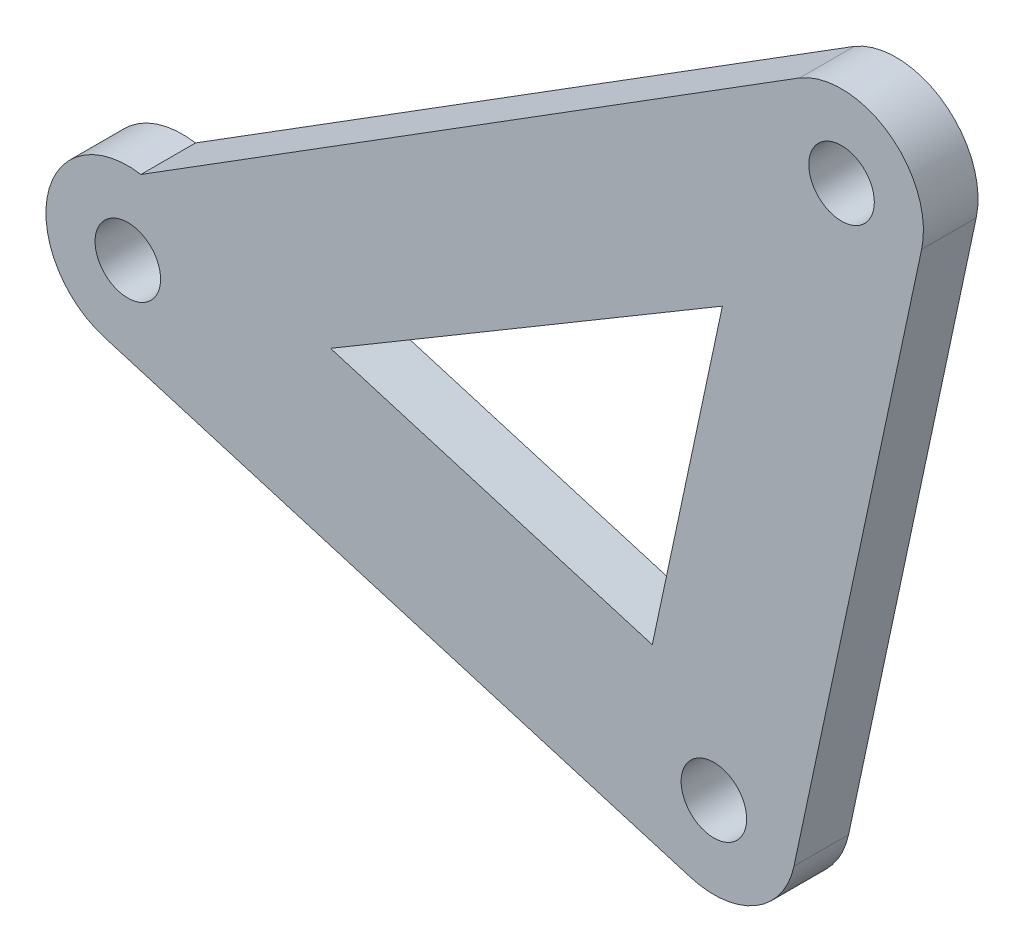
ISO-10303-21;
HEADER;
FILE_DESCRIPTION(('STEP AP214'),'2;1');
FILE_NAME('part.step','',(''),(''),'','','');
FILE_SCHEMA(('AUTOMOTIVE_DESIGN { 1 0 10303 214 1 1 1 1 }'));
ENDSEC;
DATA;
#1=APPLICATION_CONTEXT('core data for automotive mechanical design processes');
#2=APPLICATION_PROTOCOL_DEFINITION('international standard','automotive_design',2000,#1);
#3=PRODUCT_CONTEXT('',#1,'mechanical');
#4=PRODUCT('Part','Part','',(#3));
#5=PRODUCT_RELATED_PRODUCT_CATEGORY('part','',(#4));
#6=PRODUCT_DEFINITION_FORMATION('','',#4);
#7=PRODUCT_DEFINITION_CONTEXT('part definition',#1,'design');
#8=PRODUCT_DEFINITION('design','',#6,#7);
#9=PRODUCT_DEFINITION_SHAPE('','',#8);
#10=(LENGTH_UNIT() NAMED_UNIT(*) SI_UNIT(.MILLI.,.METRE.));
#11=(NAMED_UNIT(*) PLANE_ANGLE_UNIT() SI_UNIT($,.RADIAN.));
#12=(NAMED_UNIT(*) SI_UNIT($,.STERADIAN.) SOLID_ANGLE_UNIT());
#13=UNCERTAINTY_MEASURE_WITH_UNIT(LENGTH_MEASURE(1.E-05),#10,'distance_accuracy_value','');
#14=(GEOMETRIC_REPRESENTATION_CONTEXT(3) GLOBAL_UNCERTAINTY_ASSIGNED_CONTEXT((#13)) GLOBAL_UNIT_ASSIGNED_CONTEXT((#10,
#11,#12)) REPRESENTATION_CONTEXT('',''));
#15=CARTESIAN_POINT('',(0.,0.,0.));
#16=DIRECTION('',(0.,0.,1.));
#17=DIRECTION('',(1.,0.,0.));
#18=AXIS2_PLACEMENT_3D('',#15,#16,#17);
#19=CARTESIAN_POINT('',(-67.7284123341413,14.4587263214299,-5.));
#20=DIRECTION('',(0.977963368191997,-0.208776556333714,0.));
#21=DIRECTION('',(0.208776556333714,0.977963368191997,0.));
#22=AXIS2_PLACEMENT_3D('',#19,#20,#21);
#23=PLANE('',#22);
#24=DIRECTION('',(0.208776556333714,0.977963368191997,0.));
#25=VECTOR('',#24,1.);
#26=CARTESIAN_POINT('',(-67.7284123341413,14.4587263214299,0.));
#27=LINE('',#26,#25);
#28=CARTESIAN_POINT('',(-69.6397647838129,5.50545727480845,0.));
#29=VERTEX_POINT('',#28);
#30=CARTESIAN_POINT('',(-63.2214880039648,35.5703251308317,0.));
#31=VERTEX_POINT('',#30);
#32=EDGE_CURVE('E159',#29,#31,#27,.T.);
#33=ORIENTED_EDGE('',*,*,#32,.T.);
#34=DIRECTION('',(0.,0.,1.));
#35=VECTOR('',#34,1.);
#36=CARTESIAN_POINT('',(-63.2214880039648,35.5703251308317,-5.));
#37=LINE('',#36,#35);
#38=CARTESIAN_POINT('',(-63.2214880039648,35.5703251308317,-5.));
#39=VERTEX_POINT('',#38);
#40=EDGE_CURVE('E11',#39,#31,#37,.T.);
#41=ORIENTED_EDGE('',*,*,#40,.F.);
#42=DIRECTION('',(0.208776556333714,0.977963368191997,0.));
#43=VECTOR('',#42,1.);
#44=CARTESIAN_POINT('',(-67.7284123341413,14.4587263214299,-5.));
#45=LINE('',#44,#43);
#46=CARTESIAN_POINT('',(-69.6397647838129,5.50545727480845,-5.));
#47=VERTEX_POINT('',#46);
#48=EDGE_CURVE('E120',#47,#39,#45,.T.);
#49=ORIENTED_EDGE('',*,*,#48,.F.);
#50=DIRECTION('',(0.,0.,1.));
#51=VECTOR('',#50,1.);
#52=CARTESIAN_POINT('',(-69.6397647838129,5.50545727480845,-5.));
#53=LINE('',#52,#51);
#54=EDGE_CURVE('E125',#47,#29,#53,.T.);
#55=ORIENTED_EDGE('',*,*,#54,.T.);
#56=EDGE_LOOP('',(#33,#41,#49,#55));
#57=FACE_BOUND('',#56,.T.);
#58=ADVANCED_FACE('F39',(#57),#23,.F.);
#59=CARTESIAN_POINT('',(-32.0705181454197,54.0527755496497,-5.));
#60=DIRECTION('',(-0.510264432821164,0.860017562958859,0.));
#61=DIRECTION('',(-0.860017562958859,-0.510264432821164,0.));
#62=AXIS2_PLACEMENT_3D('',#59,#60,#61);
#63=PLANE('',#62);
#64=DIRECTION('',(-0.860017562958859,-0.510264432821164,0.));
#65=VECTOR('',#64,1.);
#66=CARTESIAN_POINT('',(-32.0705181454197,54.0527755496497,0.));
#67=LINE('',#66,#65);
#68=CARTESIAN_POINT('',(-99.1029059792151,14.2812117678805,0.));
#69=VERTEX_POINT('',#68);
#70=EDGE_CURVE('E86',#31,#69,#67,.T.);
#71=ORIENTED_EDGE('',*,*,#70,.T.);
#72=DIRECTION('',(0.,0.,1.));
#73=VECTOR('',#72,1.);
#74=CARTESIAN_POINT('',(-99.1029059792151,14.2812117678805,-5.));
#75=LINE('',#74,#73);
#76=CARTESIAN_POINT('',(-99.1029059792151,14.2812117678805,-5.));
#77=VERTEX_POINT('',#76);
#78=EDGE_CURVE('E49',#77,#69,#75,.T.);
#79=ORIENTED_EDGE('',*,*,#78,.F.);
#80=DIRECTION('',(-0.860017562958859,-0.510264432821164,0.));
#81=VECTOR('',#80,1.);
#82=CARTESIAN_POINT('',(-32.0705181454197,54.0527755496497,-5.));
#83=LINE('',#82,#81);
#84=EDGE_CURVE('E57',#39,#77,#83,.T.);
#85=ORIENTED_EDGE('',*,*,#84,.F.);
#86=ORIENTED_EDGE('',*,*,#40,.T.);
#87=EDGE_LOOP('',(#71,#79,#85,#86));
#88=FACE_BOUND('',#87,.T.);
#89=ADVANCED_FACE('F217',(#88),#63,.F.);
#90=CARTESIAN_POINT('',(-8.45055094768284,-28.3713241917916,-5.));
#91=DIRECTION('',(-0.285461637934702,-0.958390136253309,0.));
#92=DIRECTION('',(0.958390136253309,-0.285461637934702,0.));
#93=AXIS2_PLACEMENT_3D('',#90,#91,#92);
#94=PLANE('',#93);
#95=DIRECTION('',(0.958390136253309,-0.285461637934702,0.));
#96=VECTOR('',#95,1.);
#97=CARTESIAN_POINT('',(-8.45055094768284,-28.3713241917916,0.));
#98=LINE('',#97,#96);
#99=CARTESIAN_POINT('',(-119.810809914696,4.79792570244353,0.));
#100=VERTEX_POINT('',#99);
#101=CARTESIAN_POINT('',(-66.1409622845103,-11.1879260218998,0.));
#102=VERTEX_POINT('',#101);
#103=EDGE_CURVE('E140',#100,#102,#98,.T.);
#104=ORIENTED_EDGE('',*,*,#103,.F.);
#105=DIRECTION('',(0.,0.,1.));
#106=VECTOR('',#105,1.);
#107=CARTESIAN_POINT('',(-119.810809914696,4.79792570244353,-5.));
#108=LINE('',#107,#106);
#109=CARTESIAN_POINT('',(-119.810809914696,4.79792570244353,-5.));
#110=VERTEX_POINT('',#109);
#111=EDGE_CURVE('E130',#110,#100,#108,.T.);
#112=ORIENTED_EDGE('',*,*,#111,.F.);
#113=DIRECTION('',(0.958390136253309,-0.285461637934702,0.));
#114=VECTOR('',#113,1.);
#115=CARTESIAN_POINT('',(-8.45055094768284,-28.3713241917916,-5.));
#116=LINE('',#115,#114);
#117=CARTESIAN_POINT('',(-66.1409622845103,-11.1879260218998,-5.));
#118=VERTEX_POINT('',#117);
#119=EDGE_CURVE('E162',#110,#118,#116,.T.);
#120=ORIENTED_EDGE('',*,*,#119,.T.);
#121=DIRECTION('',(0.,0.,1.));
#122=VECTOR('',#121,1.);
#123=CARTESIAN_POINT('',(-66.1409622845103,-11.1879260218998,-5.));
#124=LINE('',#123,#122);
#125=EDGE_CURVE('E43',#118,#102,#124,.T.);
#126=ORIENTED_EDGE('',*,*,#125,.T.);
#127=EDGE_LOOP('',(#104,#112,#120,#126));
#128=FACE_BOUND('',#127,.T.);
#129=ADVANCED_FACE('F41',(#128),#94,.T.);
#130=CARTESIAN_POINT('',(-117.669847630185,11.9858517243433,-5.));
#131=DIRECTION('',(0.,0.,1.));
#132=DIRECTION('',(1.,0.,0.));
#133=AXIS2_PLACEMENT_3D('',#130,#131,#132);
#134=CYLINDRICAL_SURFACE('',#133,7.50000000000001);
#135=CARTESIAN_POINT('',(-117.669847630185,11.9858517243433,0.));
#136=DIRECTION('',(0.,0.,1.));
#137=DIRECTION('',(1.,0.,0.));
#138=AXIS2_PLACEMENT_3D('',#135,#136,#137);
#139=CIRCLE('',#138,7.50000000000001);
#140=CARTESIAN_POINT('',(-116.469329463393,19.389145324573,0.));
#141=VERTEX_POINT('',#140);
#142=EDGE_CURVE('E156',#141,#100,#139,.T.);
#143=ORIENTED_EDGE('',*,*,#142,.F.);
#144=DIRECTION('',(0.,0.,1.));
#145=VECTOR('',#144,1.);
#146=CARTESIAN_POINT('',(-116.469329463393,19.389145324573,-5.));
#147=LINE('',#146,#145);
#148=CARTESIAN_POINT('',(-116.469329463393,19.389145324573,-5.));
#149=VERTEX_POINT('',#148);
#150=EDGE_CURVE('E166',#149,#141,#147,.T.);
#151=ORIENTED_EDGE('',*,*,#150,.F.);
#152=CARTESIAN_POINT('',(-117.669847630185,11.9858517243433,-5.));
#153=DIRECTION('',(0.,0.,1.));
#154=DIRECTION('',(1.,0.,0.));
#155=AXIS2_PLACEMENT_3D('',#152,#153,#154);
#156=CIRCLE('',#155,7.50000000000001);
#157=EDGE_CURVE('E132',#149,#110,#156,.T.);
#158=ORIENTED_EDGE('',*,*,#157,.T.);
#159=ORIENTED_EDGE('',*,*,#111,.T.);
#160=EDGE_LOOP('',(#143,#151,#158,#159));
#161=FACE_BOUND('',#160,.T.);
#162=ADVANCED_FACE('F183',(#161),#134,.T.);
#163=CARTESIAN_POINT('',(-41.5898306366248,66.3356391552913,-5.));
#164=DIRECTION('',(-0.531192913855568,0.847250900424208,0.));
#165=DIRECTION('',(-0.847250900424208,-0.531192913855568,0.));
#166=AXIS2_PLACEMENT_3D('',#163,#164,#165);
#167=PLANE('',#166);
#168=DIRECTION('',(-0.847250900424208,-0.531192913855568,0.));
#169=VECTOR('',#168,1.);
#170=CARTESIAN_POINT('',(-41.5898306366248,66.3356391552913,0.));
#171=LINE('',#170,#169);
#172=CARTESIAN_POINT('',(-56.1354960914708,57.2160803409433,0.));
#173=VERTEX_POINT('',#172);
#174=EDGE_CURVE('E153',#173,#141,#171,.T.);
#175=ORIENTED_EDGE('',*,*,#174,.F.);
#176=DIRECTION('',(0.,0.,1.));
#177=VECTOR('',#176,1.);
#178=CARTESIAN_POINT('',(-56.1354960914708,57.2160803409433,-5.));
#179=LINE('',#178,#177);
#180=CARTESIAN_POINT('',(-56.1354960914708,57.2160803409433,-5.));
#181=VERTEX_POINT('',#180);
#182=EDGE_CURVE('E168',#181,#173,#179,.T.);
#183=ORIENTED_EDGE('',*,*,#182,.F.);
#184=DIRECTION('',(-0.847250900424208,-0.531192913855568,0.));
#185=VECTOR('',#184,1.);
#186=CARTESIAN_POINT('',(-41.5898306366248,66.3356391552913,-5.));
#187=LINE('',#186,#185);
#188=EDGE_CURVE('E135',#181,#149,#187,.T.);
#189=ORIENTED_EDGE('',*,*,#188,.T.);
#190=ORIENTED_EDGE('',*,*,#150,.T.);
#191=EDGE_LOOP('',(#175,#183,#189,#190));
#192=FACE_BOUND('',#191,.T.);
#193=ADVANCED_FACE('F202',(#192),#167,.T.);
#194=CARTESIAN_POINT('',(-52.308512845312,50.7659486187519,-5.));
#195=DIRECTION('',(0.,0.,1.));
#196=DIRECTION('',(1.,0.,0.));
#197=AXIS2_PLACEMENT_3D('',#194,#195,#196);
#198=CYLINDRICAL_SURFACE('',#197,7.50000000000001);
#199=CARTESIAN_POINT('',(-52.308512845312,50.7659486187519,0.));
#200=DIRECTION('',(0.,0.,1.));
#201=DIRECTION('',(1.,0.,0.));
#202=AXIS2_PLACEMENT_3D('',#199,#200,#201);
#203=CIRCLE('',#202,7.50000000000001);
#204=CARTESIAN_POINT('',(-44.9737875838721,49.200124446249,0.));
#205=VERTEX_POINT('',#204);
#206=EDGE_CURVE('E150',#205,#173,#203,.T.);
#207=ORIENTED_EDGE('',*,*,#206,.F.);
#208=DIRECTION('',(0.,0.,1.));
#209=VECTOR('',#208,1.);
#210=CARTESIAN_POINT('',(-44.9737875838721,49.200124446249,-5.));
#211=LINE('',#210,#209);
#212=CARTESIAN_POINT('',(-44.9737875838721,49.200124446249,-5.));
#213=VERTEX_POINT('',#212);
#214=EDGE_CURVE('E170',#213,#205,#211,.T.);
#215=ORIENTED_EDGE('',*,*,#214,.F.);
#216=CARTESIAN_POINT('',(-52.308512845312,50.7659486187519,-5.));
#217=DIRECTION('',(0.,0.,1.));
#218=DIRECTION('',(1.,0.,0.));
#219=AXIS2_PLACEMENT_3D('',#216,#217,#218);
#220=CIRCLE('',#219,7.50000000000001);
#221=EDGE_CURVE('E199',#213,#181,#220,.T.);
#222=ORIENTED_EDGE('',*,*,#221,.T.);
#223=ORIENTED_EDGE('',*,*,#182,.T.);
#224=EDGE_LOOP('',(#207,#215,#222,#223));
#225=FACE_BOUND('',#224,.T.);
#226=ADVANCED_FACE('F206',(#225),#198,.T.);
#227=CARTESIAN_POINT('',(-53.0589618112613,11.3270779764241,-5.));
#228=DIRECTION('',(0.977963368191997,-0.208776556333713,0.));
#229=DIRECTION('',(0.208776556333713,0.977963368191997,0.));
#230=AXIS2_PLACEMENT_3D('',#227,#228,#229);
#231=PLANE('',#230);
#232=DIRECTION('',(0.208776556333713,0.977963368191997,0.));
#233=VECTOR('',#232,1.);
#234=CARTESIAN_POINT('',(-53.0589618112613,11.3270779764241,0.));
#235=LINE('',#234,#233);
#236=CARTESIAN_POINT('',(-56.66527473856,-5.56582417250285,0.));
#237=VERTEX_POINT('',#236);
#238=EDGE_CURVE('E147',#237,#205,#235,.T.);
#239=ORIENTED_EDGE('',*,*,#238,.F.);
#240=DIRECTION('',(0.,0.,1.));
#241=VECTOR('',#240,1.);
#242=CARTESIAN_POINT('',(-56.66527473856,-5.56582417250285,-5.));
#243=LINE('',#242,#241);
#244=CARTESIAN_POINT('',(-56.66527473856,-5.56582417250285,-5.));
#245=VERTEX_POINT('',#244);
#246=EDGE_CURVE('E171',#245,#237,#243,.T.);
#247=ORIENTED_EDGE('',*,*,#246,.F.);
#248=DIRECTION('',(0.208776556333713,0.977963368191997,0.));
#249=VECTOR('',#248,1.);
#250=CARTESIAN_POINT('',(-53.0589618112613,11.3270779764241,-5.));
#251=LINE('',#250,#249);
#252=EDGE_CURVE('E191',#245,#213,#251,.T.);
#253=ORIENTED_EDGE('',*,*,#252,.T.);
#254=ORIENTED_EDGE('',*,*,#214,.T.);
#255=EDGE_LOOP('',(#239,#247,#253,#254));
#256=FACE_BOUND('',#255,.T.);
#257=ADVANCED_FACE('F208',(#256),#231,.T.);
#258=CARTESIAN_POINT('',(-64.,-4.00000000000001,-5.));
#259=DIRECTION('',(0.,0.,1.));
#260=DIRECTION('',(1.,0.,0.));
#261=AXIS2_PLACEMENT_3D('',#258,#259,#260);
#262=CYLINDRICAL_SURFACE('',#261,7.5);
#263=CARTESIAN_POINT('',(-64.,-4.00000000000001,0.));
#264=DIRECTION('',(0.,0.,1.));
#265=DIRECTION('',(1.,0.,0.));
#266=AXIS2_PLACEMENT_3D('',#263,#264,#265);
#267=CIRCLE('',#266,7.5);
#268=EDGE_CURVE('E143',#102,#237,#267,.T.);
#269=ORIENTED_EDGE('',*,*,#268,.F.);
#270=ORIENTED_EDGE('',*,*,#125,.F.);
#271=CARTESIAN_POINT('',(-64.,-4.00000000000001,-5.));
#272=DIRECTION('',(0.,0.,1.));
#273=DIRECTION('',(1.,0.,0.));
#274=AXIS2_PLACEMENT_3D('',#271,#272,#273);
#275=CIRCLE('',#274,7.5);
#276=EDGE_CURVE('E189',#118,#245,#275,.T.);
#277=ORIENTED_EDGE('',*,*,#276,.T.);
#278=ORIENTED_EDGE('',*,*,#246,.T.);
#279=EDGE_LOOP('',(#269,#270,#277,#278));
#280=FACE_BOUND('',#279,.T.);
#281=ADVANCED_FACE('F177',(#280),#262,.T.);
#282=CARTESIAN_POINT('',(-4.16862637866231,-13.995472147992,-5.));
#283=DIRECTION('',(-0.285461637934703,-0.958390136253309,0.));
#284=DIRECTION('',(0.958390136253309,-0.285461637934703,0.));
#285=AXIS2_PLACEMENT_3D('',#282,#283,#284);
#286=PLANE('',#285);
#287=DIRECTION('',(0.958390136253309,-0.285461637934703,0.));
#288=VECTOR('',#287,1.);
#289=CARTESIAN_POINT('',(-4.16862637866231,-13.995472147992,0.));
#290=LINE('',#289,#288);
#291=EDGE_CURVE('E127',#69,#29,#290,.T.);
#292=ORIENTED_EDGE('',*,*,#291,.T.);
#293=ORIENTED_EDGE('',*,*,#54,.F.);
#294=DIRECTION('',(0.958390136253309,-0.285461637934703,0.));
#295=VECTOR('',#294,1.);
#296=CARTESIAN_POINT('',(-4.16862637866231,-13.995472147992,-5.));
#297=LINE('',#296,#295);
#298=EDGE_CURVE('E116',#77,#47,#297,.T.);
#299=ORIENTED_EDGE('',*,*,#298,.F.);
#300=ORIENTED_EDGE('',*,*,#78,.T.);
#301=EDGE_LOOP('',(#292,#293,#299,#300));
#302=FACE_BOUND('',#301,.T.);
#303=ADVANCED_FACE('F126',(#302),#286,.F.);
#304=CARTESIAN_POINT('',(0.,0.,-5.));
#305=DIRECTION('',(0.,0.,1.));
#306=DIRECTION('',(1.,0.,0.));
#307=AXIS2_PLACEMENT_3D('',#304,#305,#306);
#308=PLANE('',#307);
#309=CARTESIAN_POINT('',(-117.669847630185,11.9858517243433,-5.));
#310=DIRECTION('',(0.,0.,1.));
#311=DIRECTION('',(1.,0.,0.));
#312=AXIS2_PLACEMENT_3D('',#309,#310,#311);
#313=CIRCLE('',#312,3.00000000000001);
#314=CARTESIAN_POINT('',(-114.669847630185,11.9858517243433,-5.));
#315=VERTEX_POINT('',#314);
#316=EDGE_CURVE('E144',#315,#315,#313,.T.);
#317=ORIENTED_EDGE('',*,*,#316,.T.);
#318=EDGE_LOOP('',(#317));
#319=FACE_BOUND('',#318,.T.);
#320=CARTESIAN_POINT('',(-64.,-4.,-5.));
#321=DIRECTION('',(0.,0.,1.));
#322=DIRECTION('',(1.,0.,0.));
#323=AXIS2_PLACEMENT_3D('',#320,#321,#322);
#324=CIRCLE('',#323,3.);
#325=CARTESIAN_POINT('',(-61.,-4.,-5.));
#326=VERTEX_POINT('',#325);
#327=EDGE_CURVE('E420',#326,#326,#324,.T.);
#328=ORIENTED_EDGE('',*,*,#327,.T.);
#329=EDGE_LOOP('',(#328));
#330=FACE_BOUND('',#329,.T.);
#331=CARTESIAN_POINT('',(-52.308512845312,50.7659486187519,-5.));
#332=DIRECTION('',(0.,0.,1.));
#333=DIRECTION('',(1.,0.,0.));
#334=AXIS2_PLACEMENT_3D('',#331,#332,#333);
#335=CIRCLE('',#334,3.00000000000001);
#336=CARTESIAN_POINT('',(-49.308512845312,50.7659486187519,-5.));
#337=VERTEX_POINT('',#336);
#338=EDGE_CURVE('E194',#337,#337,#335,.T.);
#339=ORIENTED_EDGE('',*,*,#338,.T.);
#340=EDGE_LOOP('',(#339));
#341=FACE_BOUND('',#340,.T.);
#342=ORIENTED_EDGE('',*,*,#119,.F.);
#343=ORIENTED_EDGE('',*,*,#157,.F.);
#344=ORIENTED_EDGE('',*,*,#188,.F.);
#345=ORIENTED_EDGE('',*,*,#221,.F.);
#346=ORIENTED_EDGE('',*,*,#252,.F.);
#347=ORIENTED_EDGE('',*,*,#276,.F.);
#348=EDGE_LOOP('',(#342,#343,#344,#345,#346,#347));
#349=FACE_BOUND('',#348,.T.);
#350=ORIENTED_EDGE('',*,*,#48,.T.);
#351=ORIENTED_EDGE('',*,*,#84,.T.);
#352=ORIENTED_EDGE('',*,*,#298,.T.);
#353=EDGE_LOOP('',(#350,#351,#352));
#354=FACE_BOUND('',#353,.T.);
#355=ADVANCED_FACE('F118',(#319,#330,#341,#349,#354),#308,.F.);
#356=CARTESIAN_POINT('',(0.,0.,0.));
#357=DIRECTION('',(0.,0.,1.));
#358=DIRECTION('',(1.,0.,0.));
#359=AXIS2_PLACEMENT_3D('',#356,#357,#358);
#360=PLANE('',#359);
#361=CARTESIAN_POINT('',(-117.669847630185,11.9858517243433,0.));
#362=DIRECTION('',(0.,0.,1.));
#363=DIRECTION('',(1.,0.,0.));
#364=AXIS2_PLACEMENT_3D('',#361,#362,#363);
#365=CIRCLE('',#364,3.00000000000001);
#366=CARTESIAN_POINT('',(-114.669847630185,11.9858517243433,0.));
#367=VERTEX_POINT('',#366);
#368=EDGE_CURVE('E415',#367,#367,#365,.T.);
#369=ORIENTED_EDGE('',*,*,#368,.F.);
#370=EDGE_LOOP('',(#369));
#371=FACE_BOUND('',#370,.T.);
#372=CARTESIAN_POINT('',(-64.,-4.,0.));
#373=DIRECTION('',(0.,0.,1.));
#374=DIRECTION('',(1.,0.,0.));
#375=AXIS2_PLACEMENT_3D('',#372,#373,#374);
#376=CIRCLE('',#375,3.);
#377=CARTESIAN_POINT('',(-61.,-4.,0.));
#378=VERTEX_POINT('',#377);
#379=EDGE_CURVE('E416',#378,#378,#376,.T.);
#380=ORIENTED_EDGE('',*,*,#379,.F.);
#381=EDGE_LOOP('',(#380));
#382=FACE_BOUND('',#381,.T.);
#383=CARTESIAN_POINT('',(-52.308512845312,50.7659486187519,0.));
#384=DIRECTION('',(0.,0.,1.));
#385=DIRECTION('',(1.,0.,0.));
#386=AXIS2_PLACEMENT_3D('',#383,#384,#385);
#387=CIRCLE('',#386,3.00000000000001);
#388=CARTESIAN_POINT('',(-49.308512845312,50.7659486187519,0.));
#389=VERTEX_POINT('',#388);
#390=EDGE_CURVE('E424',#389,#389,#387,.T.);
#391=ORIENTED_EDGE('',*,*,#390,.F.);
#392=EDGE_LOOP('',(#391));
#393=FACE_BOUND('',#392,.T.);
#394=ORIENTED_EDGE('',*,*,#103,.T.);
#395=ORIENTED_EDGE('',*,*,#268,.T.);
#396=ORIENTED_EDGE('',*,*,#238,.T.);
#397=ORIENTED_EDGE('',*,*,#206,.T.);
#398=ORIENTED_EDGE('',*,*,#174,.T.);
#399=ORIENTED_EDGE('',*,*,#142,.T.);
#400=EDGE_LOOP('',(#394,#395,#396,#397,#398,#399));
#401=FACE_BOUND('',#400,.T.);
#402=ORIENTED_EDGE('',*,*,#32,.F.);
#403=ORIENTED_EDGE('',*,*,#291,.F.);
#404=ORIENTED_EDGE('',*,*,#70,.F.);
#405=EDGE_LOOP('',(#402,#403,#404));
#406=FACE_BOUND('',#405,.T.);
#407=ADVANCED_FACE('F179',(#371,#382,#393,#401,#406),#360,.T.);
#408=CARTESIAN_POINT('',(-52.308512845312,50.7659486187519,-5.));
#409=DIRECTION('',(0.,0.,1.));
#410=DIRECTION('',(1.,0.,0.));
#411=AXIS2_PLACEMENT_3D('',#408,#409,#410);
#412=CYLINDRICAL_SURFACE('',#411,3.00000000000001);
#413=ORIENTED_EDGE('',*,*,#338,.F.);
#414=EDGE_LOOP('',(#413));
#415=FACE_BOUND('',#414,.T.);
#416=ORIENTED_EDGE('',*,*,#390,.T.);
#417=EDGE_LOOP('',(#416));
#418=FACE_BOUND('',#417,.T.);
#419=ADVANCED_FACE('F279',(#415,#418),#412,.F.);
#420=CARTESIAN_POINT('',(-64.,-4.,-5.));
#421=DIRECTION('',(0.,0.,1.));
#422=DIRECTION('',(1.,0.,0.));
#423=AXIS2_PLACEMENT_3D('',#420,#421,#422);
#424=CYLINDRICAL_SURFACE('',#423,3.);
#425=ORIENTED_EDGE('',*,*,#327,.F.);
#426=EDGE_LOOP('',(#425));
#427=FACE_BOUND('',#426,.T.);
#428=ORIENTED_EDGE('',*,*,#379,.T.);
#429=EDGE_LOOP('',(#428));
#430=FACE_BOUND('',#429,.T.);
#431=ADVANCED_FACE('F290',(#427,#430),#424,.F.);
#432=CARTESIAN_POINT('',(-117.669847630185,11.9858517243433,-5.));
#433=DIRECTION('',(0.,0.,1.));
#434=DIRECTION('',(1.,0.,0.));
#435=AXIS2_PLACEMENT_3D('',#432,#433,#434);
#436=CYLINDRICAL_SURFACE('',#435,3.00000000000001);
#437=ORIENTED_EDGE('',*,*,#316,.F.);
#438=EDGE_LOOP('',(#437));
#439=FACE_BOUND('',#438,.T.);
#440=ORIENTED_EDGE('',*,*,#368,.T.);
#441=EDGE_LOOP('',(#440));
#442=FACE_BOUND('',#441,.T.);
#443=ADVANCED_FACE('F301',(#439,#442),#436,.F.);
#444=CLOSED_SHELL('',(#58,#89,#129,#162,#193,#226,#257,#281,#303,#355,#407,#419,#431,#443));
#445=MANIFOLD_SOLID_BREP('B2',#444);
#446=ADVANCED_BREP_SHAPE_REPRESENTATION('',(#18,#445),#14);
#447=SHAPE_DEFINITION_REPRESENTATION(#9,#446);
ENDSEC;
END-ISO-10303-21;
